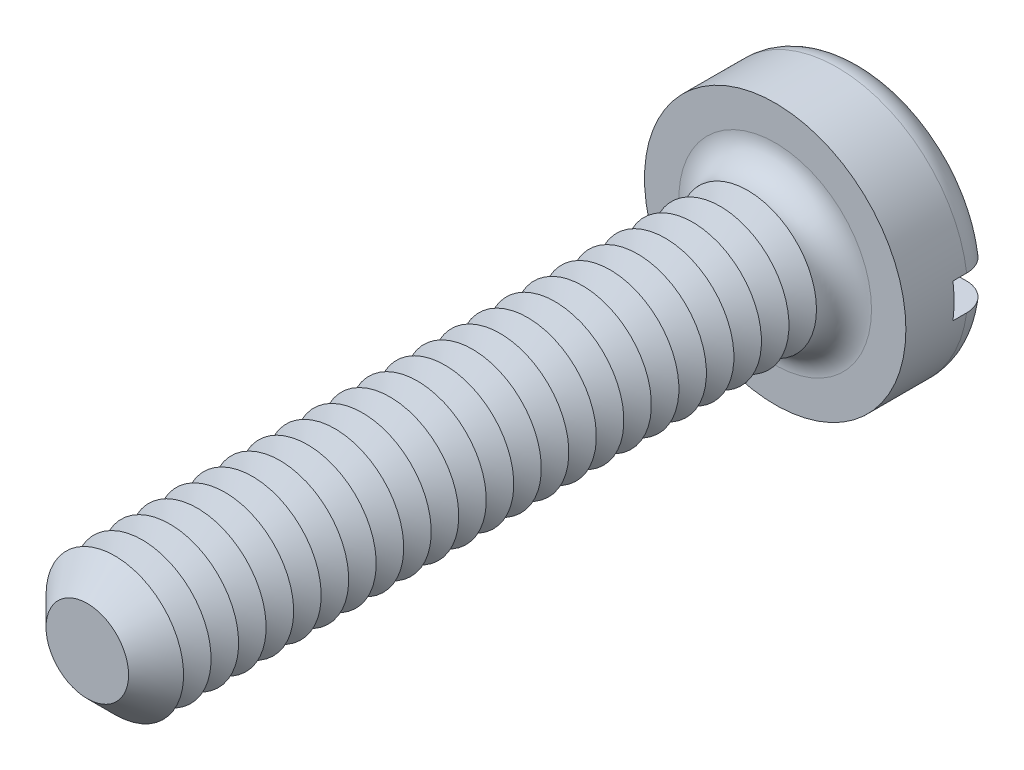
from build123d import *

# Parameters (mm, degrees)
SKETCH3_R           = 1.9
BOSS_EXTRUDE2_DEPTH = 1.3
SKETCH4_R           = 1
BOSS_EXTRUDE3_DEPTH = 10
FILLET1_R           = 0.4
CHAMFER1_SIZE       = 0.4
LPATTERN1_COUNT     = 23
LPATTERN1_PITCH     = 0.4
SKETCH8_W           = 3.8
SKETCH8_H           = 0.5
CUT_EXTRUDE1_DEPTH  = 0.6


with BuildPart() as part:
    # Sketch3 → Boss-Extrude2 (new body)
    with BuildSketch(Plane.XY):
        Circle(SKETCH3_R)
    extrude(amount=-BOSS_EXTRUDE2_DEPTH)

    # Sketch4 → Boss-Extrude3 (add)
    with BuildSketch(Plane.XY):
        Circle(SKETCH4_R)
    extrude(amount=BOSS_EXTRUDE3_DEPTH)

    # Fillet1
    fillet1_edges = [part.edges().sort_by_distance(p)[0] for p in [
        (-1.9, 0, -1.3),
        (-1, 0, 0),
    ]]
    fillet(fillet1_edges, radius=FILLET1_R)

    # Chamfer1
    chamfer1_edges = [part.edges().sort_by_distance(p)[0] for p in [
        (-1, 0, 10),
    ]]
    chamfer(chamfer1_edges, length=CHAMFER1_SIZE)

    # Sketch6 → Cut-Revolve1 (revolve, cut)
    with BuildSketch(Plane(origin=(0, 0, 0), x_dir=(0, 0, -1), z_dir=(1, 0, 0)), mode=Mode.PRIVATE) as cut_revolve1_sk:
        Polygon((-0.4, 1), (-0.6, 0.653589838), (-0.8, 1), align=None)
    cut_revolve1 = revolve(cut_revolve1_sk.sketch.rotate(Axis((0, 0, -1.694361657), (0, 0, 1)), 90), axis=Axis((0, 0, -1.694361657), (0, 0, 1)), mode=Mode.SUBTRACT)

    # LPattern1: Cut-Revolve1 ×23
    with Locations(*[(0, 0, i * LPATTERN1_PITCH) for i in range(1, LPATTERN1_COUNT)]):
        add(cut_revolve1, mode=Mode.SUBTRACT)

    # Sketch8 → Cut-Extrude1 (cut)
    with BuildSketch(Plane(origin=(0, 0, -1.3), x_dir=(-1, 0, 0), z_dir=(0, 0, -1))):
        Rectangle(SKETCH8_W, SKETCH8_H)
    extrude(amount=-CUT_EXTRUDE1_DEPTH, mode=Mode.SUBTRACT)


solid = part.part
